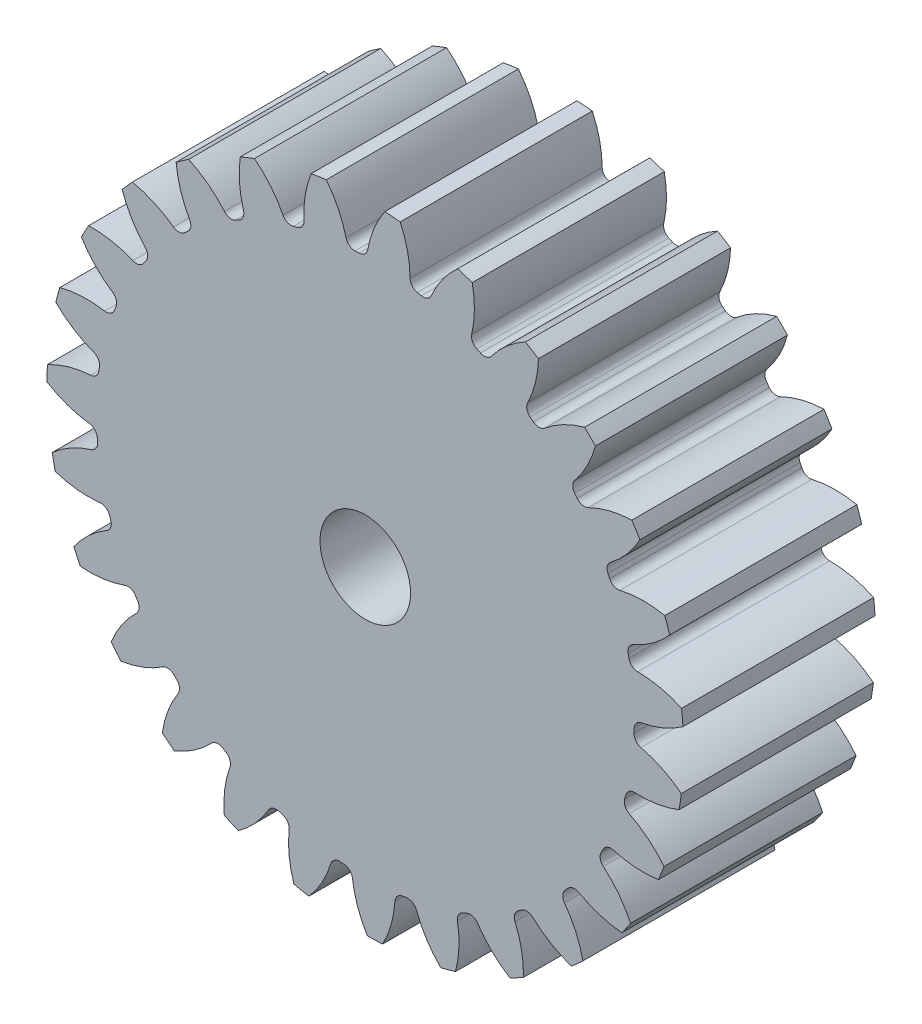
from build123d import *

# Parameters (mm, degrees)
SKETCH3_R         = 147.32
GEARBODY_DEPTH    = 88.9
TOOTHCUT_DEPTH    = 227.516168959
CIRPATTERN1_COUNT = 27
BOREDIA_R         = 20.955
BORE_DEPTH        = 12700


with BuildPart() as part:
    # Sketch3 → gearBody (new body)
    with BuildSketch(Plane.XY):
        Circle(SKETCH3_R)
    extrude(amount=GEARBODY_DEPTH)

    # Sketch2 → toothCut (cut, through all)
    with BuildSketch(Plane.XY):
        with BuildLine():
            ThreePointArc((124.382486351, -4.391889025), (124.412350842, -3.443625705), (124.434986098, -2.495162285))
            ThreePointArc((124.434986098, -2.495162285), (125.419863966, 0.101569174), (127.825356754, 1.489590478))
            ThreePointArc((127.825356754, 1.489590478), (138.026994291, 4.540490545), (147.32, 9.73870606))
            ThreePointArc((147.32, 9.73870606), (147.58501742, -4.085024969), (146.555733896, -17.872930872))
            ThreePointArc((146.555733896, -17.872930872), (137.564500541, -12.168623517), (127.547245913, -8.558082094))
            ThreePointArc((127.547245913, -8.558082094), (125.222215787, -7.039124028), (124.382486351, -4.391889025))
        make_face()
    toothcut = extrude(amount=TOOTHCUT_DEPTH, mode=Mode.SUBTRACT)

    # CirPattern1: toothCut ×27 about axis
    cirpattern1_axis = Axis((0, 0, 0), (0, 0, 1))
    for i in range(1, CIRPATTERN1_COUNT):
        add(toothcut.rotate(cirpattern1_axis, i * 360 / CIRPATTERN1_COUNT), mode=Mode.SUBTRACT)

    # boreDia → bore (cut, symmetric)
    with BuildSketch(Plane.XY):
        Circle(BOREDIA_R)
    extrude(amount=BORE_DEPTH, both=True, mode=Mode.SUBTRACT)


solid = part.part
